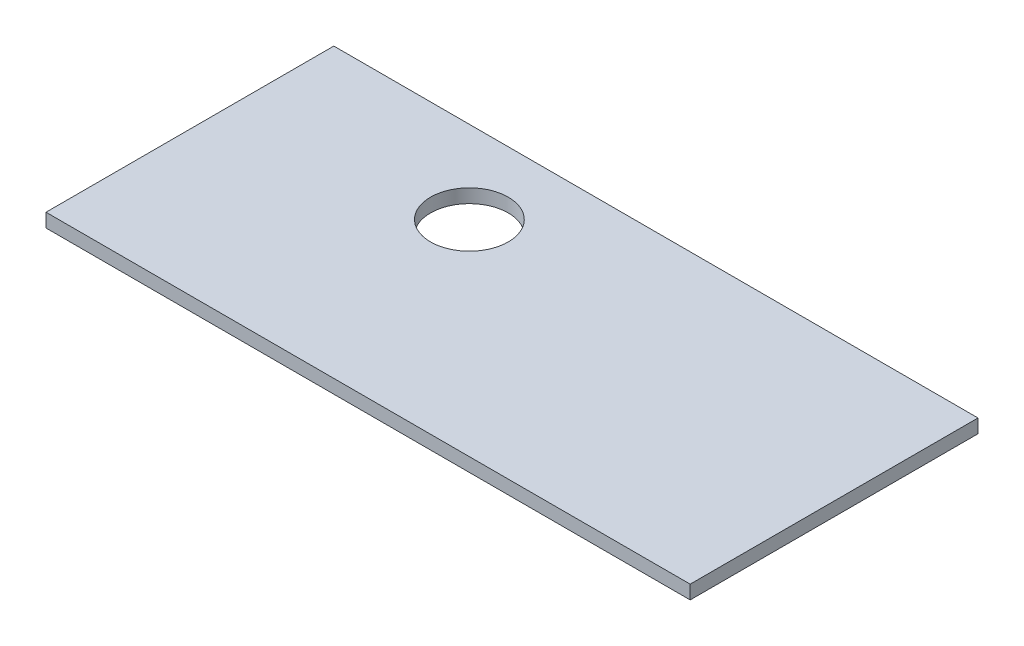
from build123d import *

# Parameters (mm, degrees)
SKETCH1_W           = 141
SKETCH1_H           = 63
BOSS_EXTRUDE1_DEPTH = 3
CUT_EXTRUDE1_REACH  = 79.275
SKETCH2_R           = 8.5


with BuildPart() as part:
    # Sketch1 → Boss-Extrude1 (new body)
    with BuildSketch(Plane(origin=(0, 0, 0), x_dir=(1, 0, 0), z_dir=(0, 1, 0))):
        Rectangle(SKETCH1_W, SKETCH1_H)
    extrude(amount=BOSS_EXTRUDE1_DEPTH)

    # Sketch2 → Cut-Extrude1 (cut, up to next)
    with BuildSketch(Plane(origin=(0, 3, 0), x_dir=(1, 0, 0), z_dir=(0, 1, 0)), mode=Mode.PRIVATE) as cut_extrude1_sk1:
        with Locations(Location((-22.779422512, 13.453404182, 0), (0, 0, 270))):
            Circle(SKETCH2_R)
    cut_extrude1_tool1 = extrude(cut_extrude1_sk1.sketch, amount=-CUT_EXTRUDE1_REACH, mode=Mode.PRIVATE) & part.part
    add(cut_extrude1_tool1.solids().sort_by_distance((-22.779423, 3, -13.453404))[0], mode=Mode.SUBTRACT)


solid = part.part
